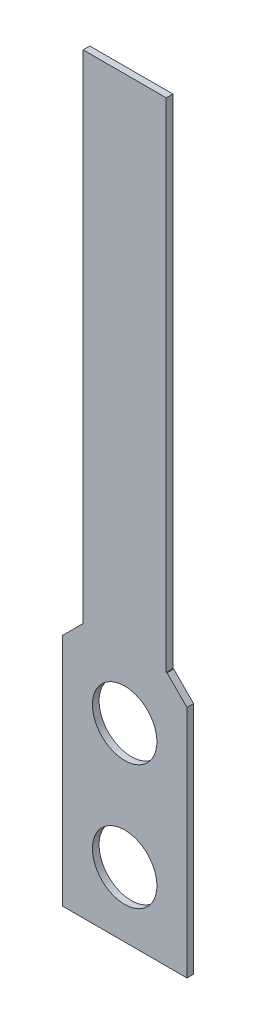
from build123d import *

# Parameters (mm, degrees)
BOSS_EXTRUDE1_DEPTH = 0.508
SKETCH2_R           = 2.4638
CUT_EXTRUDE1_DEPTH  = 61.451533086
CHAMFER1_SIZE       = 1.524
SKETCH3_W           = 6.35
SKETCH3_H           = 12.518092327
CUT_EXTRUDE2_DEPTH  = 61.451533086


with BuildPart() as part:
    # Sketch1 → Boss-Extrude1 (new body)
    with BuildSketch(Plane.XY):
        Polygon((-4.7625, -9.7155), (4.7625, -9.7155), (4.7625, 9.7155), (3.175, 9.7155), (3.175, 60.2615), (-3.175, 60.2615), (-3.175, 9.7155), (-4.7625, 9.7155), align=None)
    extrude(amount=BOSS_EXTRUDE1_DEPTH)

    # Sketch2 → Cut-Extrude1 (cut, through all)
    with BuildSketch(Plane.XY.offset(0.508)):
        with Locations((0, 4.7625)):
            Circle(SKETCH2_R)
        with Locations((0, -4.7625)):
            Circle(SKETCH2_R)
    extrude(amount=-CUT_EXTRUDE1_DEPTH, mode=Mode.SUBTRACT)

    # Chamfer1
    chamfer1_edges = [part.edges().sort_by_distance(p)[0] for p in [
        (4.7625, 9.7155, 0.254),
        (-4.7625, 9.7155, 0.254),
    ]]
    chamfer(chamfer1_edges, length=CHAMFER1_SIZE)

    # Sketch3 → Cut-Extrude2 (cut, through all)
    with BuildSketch(Plane.XY.offset(0.508)):
        with Locations((0, 54.002453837)):
            Rectangle(SKETCH3_W, SKETCH3_H)
    extrude(amount=-CUT_EXTRUDE2_DEPTH, mode=Mode.SUBTRACT)


solid = part.part
